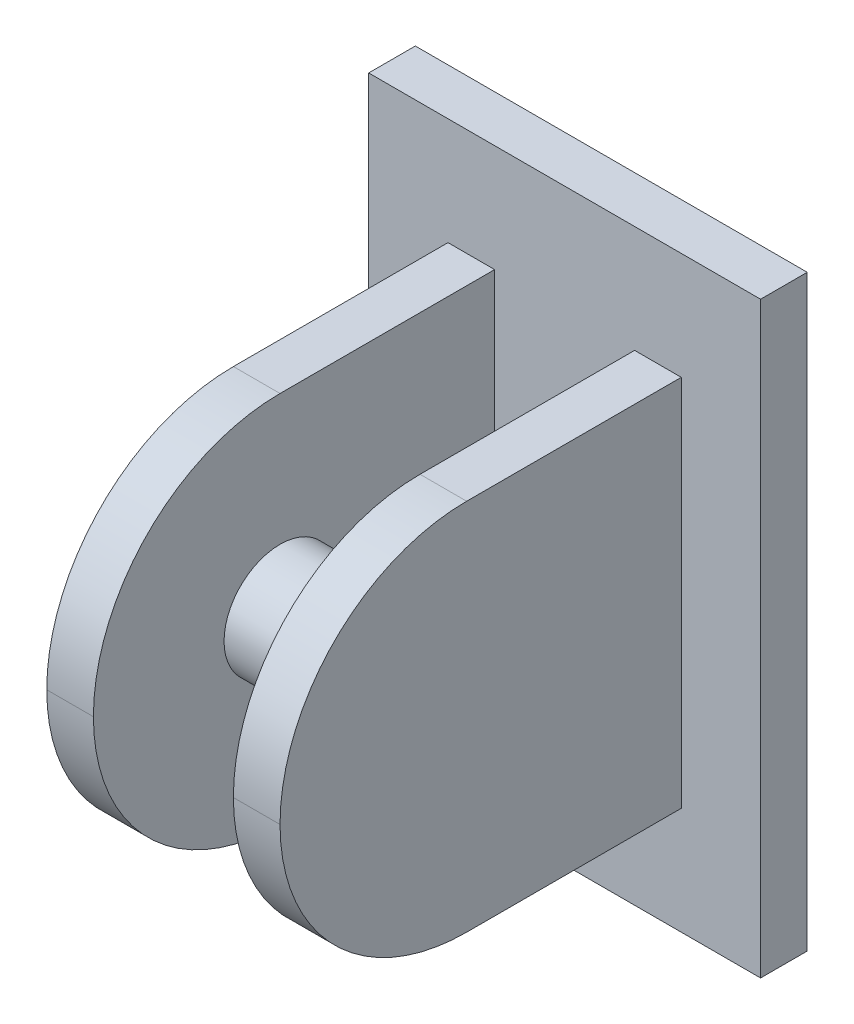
ISO-10303-21;
HEADER;
FILE_DESCRIPTION(('STEP AP214'),'2;1');
FILE_NAME('part.step','',(''),(''),'','','');
FILE_SCHEMA(('AUTOMOTIVE_DESIGN { 1 0 10303 214 1 1 1 1 }'));
ENDSEC;
DATA;
#1=APPLICATION_CONTEXT('core data for automotive mechanical design processes');
#2=APPLICATION_PROTOCOL_DEFINITION('international standard','automotive_design',2000,#1);
#3=PRODUCT_CONTEXT('',#1,'mechanical');
#4=PRODUCT('Part','Part','',(#3));
#5=PRODUCT_RELATED_PRODUCT_CATEGORY('part','',(#4));
#6=PRODUCT_DEFINITION_FORMATION('','',#4);
#7=PRODUCT_DEFINITION_CONTEXT('part definition',#1,'design');
#8=PRODUCT_DEFINITION('design','',#6,#7);
#9=PRODUCT_DEFINITION_SHAPE('','',#8);
#10=(LENGTH_UNIT() NAMED_UNIT(*) SI_UNIT(.MILLI.,.METRE.));
#11=(NAMED_UNIT(*) PLANE_ANGLE_UNIT() SI_UNIT($,.RADIAN.));
#12=(NAMED_UNIT(*) SI_UNIT($,.STERADIAN.) SOLID_ANGLE_UNIT());
#13=UNCERTAINTY_MEASURE_WITH_UNIT(LENGTH_MEASURE(1.E-05),#10,'distance_accuracy_value','');
#14=(GEOMETRIC_REPRESENTATION_CONTEXT(3) GLOBAL_UNCERTAINTY_ASSIGNED_CONTEXT((#13)) GLOBAL_UNIT_ASSIGNED_CONTEXT((#10,
#11,#12)) REPRESENTATION_CONTEXT('',''));
#15=CARTESIAN_POINT('',(0.,0.,0.));
#16=DIRECTION('',(0.,0.,1.));
#17=DIRECTION('',(1.,0.,0.));
#18=AXIS2_PLACEMENT_3D('',#15,#16,#17);
#19=CARTESIAN_POINT('',(-21.,-31.5,5.));
#20=DIRECTION('',(0.,0.,1.));
#21=DIRECTION('',(1.,0.,0.));
#22=AXIS2_PLACEMENT_3D('',#19,#20,#21);
#23=PLANE('',#22);
#24=DIRECTION('',(-1.,0.,0.));
#25=VECTOR('',#24,1.);
#26=CARTESIAN_POINT('',(-7.5,20.,5.));
#27=LINE('',#26,#25);
#28=CARTESIAN_POINT('',(-7.5,20.,5.));
#29=VERTEX_POINT('',#28);
#30=CARTESIAN_POINT('',(-12.5,20.,5.));
#31=VERTEX_POINT('',#30);
#32=EDGE_CURVE('E150',#29,#31,#27,.T.);
#33=ORIENTED_EDGE('',*,*,#32,.F.);
#34=DIRECTION('',(0.,1.,0.));
#35=VECTOR('',#34,1.);
#36=CARTESIAN_POINT('',(-7.5,20.,5.));
#37=LINE('',#36,#35);
#38=CARTESIAN_POINT('',(-7.5,-20.,5.));
#39=VERTEX_POINT('',#38);
#40=EDGE_CURVE('E124',#39,#29,#37,.T.);
#41=ORIENTED_EDGE('',*,*,#40,.F.);
#42=DIRECTION('',(1.,0.,0.));
#43=VECTOR('',#42,1.);
#44=CARTESIAN_POINT('',(-7.5,-20.,5.));
#45=LINE('',#44,#43);
#46=CARTESIAN_POINT('',(-12.5,-20.,5.));
#47=VERTEX_POINT('',#46);
#48=EDGE_CURVE('E156',#47,#39,#45,.T.);
#49=ORIENTED_EDGE('',*,*,#48,.F.);
#50=DIRECTION('',(0.,-1.,0.));
#51=VECTOR('',#50,1.);
#52=CARTESIAN_POINT('',(-12.5,20.,5.));
#53=LINE('',#52,#51);
#54=EDGE_CURVE('E153',#31,#47,#53,.T.);
#55=ORIENTED_EDGE('',*,*,#54,.F.);
#56=EDGE_LOOP('',(#33,#41,#49,#55));
#57=FACE_BOUND('',#56,.T.);
#58=DIRECTION('',(0.,-1.,0.));
#59=VECTOR('',#58,1.);
#60=CARTESIAN_POINT('',(-21.,31.5,5.));
#61=LINE('',#60,#59);
#62=CARTESIAN_POINT('',(-21.,31.5,5.));
#63=VERTEX_POINT('',#62);
#64=CARTESIAN_POINT('',(-21.,-31.5,5.));
#65=VERTEX_POINT('',#64);
#66=EDGE_CURVE('E176',#63,#65,#61,.T.);
#67=ORIENTED_EDGE('',*,*,#66,.T.);
#68=DIRECTION('',(1.,0.,0.));
#69=VECTOR('',#68,1.);
#70=CARTESIAN_POINT('',(-21.,-31.5,5.));
#71=LINE('',#70,#69);
#72=CARTESIAN_POINT('',(21.,-31.5,5.));
#73=VERTEX_POINT('',#72);
#74=EDGE_CURVE('E179',#65,#73,#71,.T.);
#75=ORIENTED_EDGE('',*,*,#74,.T.);
#76=DIRECTION('',(0.,1.,0.));
#77=VECTOR('',#76,1.);
#78=CARTESIAN_POINT('',(21.,31.5,5.));
#79=LINE('',#78,#77);
#80=CARTESIAN_POINT('',(21.,31.5,5.));
#81=VERTEX_POINT('',#80);
#82=EDGE_CURVE('E181',#73,#81,#79,.T.);
#83=ORIENTED_EDGE('',*,*,#82,.T.);
#84=DIRECTION('',(-1.,0.,0.));
#85=VECTOR('',#84,1.);
#86=CARTESIAN_POINT('',(-21.,31.5,5.));
#87=LINE('',#86,#85);
#88=EDGE_CURVE('E183',#81,#63,#87,.T.);
#89=ORIENTED_EDGE('',*,*,#88,.T.);
#90=EDGE_LOOP('',(#67,#75,#83,#89));
#91=FACE_BOUND('',#90,.T.);
#92=DIRECTION('',(1.,0.,0.));
#93=VECTOR('',#92,1.);
#94=CARTESIAN_POINT('',(7.5,-20.,5.));
#95=LINE('',#94,#93);
#96=CARTESIAN_POINT('',(7.5,-20.,5.));
#97=VERTEX_POINT('',#96);
#98=CARTESIAN_POINT('',(12.5,-20.,5.));
#99=VERTEX_POINT('',#98);
#100=EDGE_CURVE('E120',#97,#99,#95,.T.);
#101=ORIENTED_EDGE('',*,*,#100,.F.);
#102=DIRECTION('',(0.,-1.,0.));
#103=VECTOR('',#102,1.);
#104=CARTESIAN_POINT('',(7.5,20.,5.));
#105=LINE('',#104,#103);
#106=CARTESIAN_POINT('',(7.5,20.,5.));
#107=VERTEX_POINT('',#106);
#108=EDGE_CURVE('E128',#107,#97,#105,.T.);
#109=ORIENTED_EDGE('',*,*,#108,.F.);
#110=DIRECTION('',(-1.,0.,0.));
#111=VECTOR('',#110,1.);
#112=CARTESIAN_POINT('',(7.5,20.,5.));
#113=LINE('',#112,#111);
#114=CARTESIAN_POINT('',(12.5,20.,5.));
#115=VERTEX_POINT('',#114);
#116=EDGE_CURVE('E139',#115,#107,#113,.T.);
#117=ORIENTED_EDGE('',*,*,#116,.F.);
#118=DIRECTION('',(0.,1.,0.));
#119=VECTOR('',#118,1.);
#120=CARTESIAN_POINT('',(12.5,20.,5.));
#121=LINE('',#120,#119);
#122=EDGE_CURVE('E137',#99,#115,#121,.T.);
#123=ORIENTED_EDGE('',*,*,#122,.F.);
#124=EDGE_LOOP('',(#101,#109,#117,#123));
#125=FACE_BOUND('',#124,.T.);
#126=ADVANCED_FACE('F17',(#57,#91,#125),#23,.T.);
#127=CARTESIAN_POINT('',(-21.,31.5,5.));
#128=DIRECTION('',(1.,0.,0.));
#129=DIRECTION('',(0.,1.,0.));
#130=AXIS2_PLACEMENT_3D('',#127,#128,#129);
#131=PLANE('',#130);
#132=DIRECTION('',(0.,-1.,0.));
#133=VECTOR('',#132,1.);
#134=CARTESIAN_POINT('',(-21.,31.5,0.));
#135=LINE('',#134,#133);
#136=CARTESIAN_POINT('',(-21.,31.5,0.));
#137=VERTEX_POINT('',#136);
#138=CARTESIAN_POINT('',(-21.,-31.5,0.));
#139=VERTEX_POINT('',#138);
#140=EDGE_CURVE('E167',#137,#139,#135,.T.);
#141=ORIENTED_EDGE('',*,*,#140,.T.);
#142=DIRECTION('',(0.,0.,-1.));
#143=VECTOR('',#142,1.);
#144=CARTESIAN_POINT('',(-21.,-31.5,5.));
#145=LINE('',#144,#143);
#146=EDGE_CURVE('E194',#65,#139,#145,.T.);
#147=ORIENTED_EDGE('',*,*,#146,.F.);
#148=ORIENTED_EDGE('',*,*,#66,.F.);
#149=DIRECTION('',(0.,0.,-1.));
#150=VECTOR('',#149,1.);
#151=CARTESIAN_POINT('',(-21.,31.5,5.));
#152=LINE('',#151,#150);
#153=EDGE_CURVE('E185',#63,#137,#152,.T.);
#154=ORIENTED_EDGE('',*,*,#153,.T.);
#155=EDGE_LOOP('',(#141,#147,#148,#154));
#156=FACE_BOUND('',#155,.T.);
#157=ADVANCED_FACE('F19',(#156),#131,.F.);
#158=CARTESIAN_POINT('',(-21.,-31.5,5.));
#159=DIRECTION('',(0.,1.,0.));
#160=DIRECTION('',(0.,0.,1.));
#161=AXIS2_PLACEMENT_3D('',#158,#159,#160);
#162=PLANE('',#161);
#163=DIRECTION('',(1.,0.,0.));
#164=VECTOR('',#163,1.);
#165=CARTESIAN_POINT('',(-21.,-31.5,0.));
#166=LINE('',#165,#164);
#167=CARTESIAN_POINT('',(21.,-31.5,0.));
#168=VERTEX_POINT('',#167);
#169=EDGE_CURVE('E170',#139,#168,#166,.T.);
#170=ORIENTED_EDGE('',*,*,#169,.T.);
#171=DIRECTION('',(0.,0.,-1.));
#172=VECTOR('',#171,1.);
#173=CARTESIAN_POINT('',(21.,-31.5,5.));
#174=LINE('',#173,#172);
#175=EDGE_CURVE('E191',#73,#168,#174,.T.);
#176=ORIENTED_EDGE('',*,*,#175,.F.);
#177=ORIENTED_EDGE('',*,*,#74,.F.);
#178=ORIENTED_EDGE('',*,*,#146,.T.);
#179=EDGE_LOOP('',(#170,#176,#177,#178));
#180=FACE_BOUND('',#179,.T.);
#181=ADVANCED_FACE('F249',(#180),#162,.F.);
#182=CARTESIAN_POINT('',(21.,31.5,5.));
#183=DIRECTION('',(-1.,0.,0.));
#184=DIRECTION('',(0.,-1.,0.));
#185=AXIS2_PLACEMENT_3D('',#182,#183,#184);
#186=PLANE('',#185);
#187=DIRECTION('',(0.,1.,0.));
#188=VECTOR('',#187,1.);
#189=CARTESIAN_POINT('',(21.,31.5,0.));
#190=LINE('',#189,#188);
#191=CARTESIAN_POINT('',(21.,31.5,0.));
#192=VERTEX_POINT('',#191);
#193=EDGE_CURVE('E172',#168,#192,#190,.T.);
#194=ORIENTED_EDGE('',*,*,#193,.T.);
#195=DIRECTION('',(0.,0.,-1.));
#196=VECTOR('',#195,1.);
#197=CARTESIAN_POINT('',(21.,31.5,5.));
#198=LINE('',#197,#196);
#199=EDGE_CURVE('E188',#81,#192,#198,.T.);
#200=ORIENTED_EDGE('',*,*,#199,.F.);
#201=ORIENTED_EDGE('',*,*,#82,.F.);
#202=ORIENTED_EDGE('',*,*,#175,.T.);
#203=EDGE_LOOP('',(#194,#200,#201,#202));
#204=FACE_BOUND('',#203,.T.);
#205=ADVANCED_FACE('F260',(#204),#186,.F.);
#206=CARTESIAN_POINT('',(-21.,31.5,5.));
#207=DIRECTION('',(0.,-1.,0.));
#208=DIRECTION('',(0.,0.,-1.));
#209=AXIS2_PLACEMENT_3D('',#206,#207,#208);
#210=PLANE('',#209);
#211=DIRECTION('',(-1.,0.,0.));
#212=VECTOR('',#211,1.);
#213=CARTESIAN_POINT('',(-21.,31.5,0.));
#214=LINE('',#213,#212);
#215=EDGE_CURVE('E174',#192,#137,#214,.T.);
#216=ORIENTED_EDGE('',*,*,#215,.T.);
#217=ORIENTED_EDGE('',*,*,#153,.F.);
#218=ORIENTED_EDGE('',*,*,#88,.F.);
#219=ORIENTED_EDGE('',*,*,#199,.T.);
#220=EDGE_LOOP('',(#216,#217,#218,#219));
#221=FACE_BOUND('',#220,.T.);
#222=ADVANCED_FACE('F257',(#221),#210,.F.);
#223=CARTESIAN_POINT('',(-21.,-31.5,0.));
#224=DIRECTION('',(0.,0.,1.));
#225=DIRECTION('',(1.,0.,0.));
#226=AXIS2_PLACEMENT_3D('',#223,#224,#225);
#227=PLANE('',#226);
#228=ORIENTED_EDGE('',*,*,#140,.F.);
#229=ORIENTED_EDGE('',*,*,#215,.F.);
#230=ORIENTED_EDGE('',*,*,#193,.F.);
#231=ORIENTED_EDGE('',*,*,#169,.F.);
#232=EDGE_LOOP('',(#228,#229,#230,#231));
#233=FACE_BOUND('',#232,.T.);
#234=ADVANCED_FACE('F255',(#233),#227,.F.);
#235=CARTESIAN_POINT('',(-7.5,20.,48.));
#236=DIRECTION('',(-1.,0.,0.));
#237=DIRECTION('',(0.,-1.,0.));
#238=AXIS2_PLACEMENT_3D('',#235,#236,#237);
#239=PLANE('',#238);
#240=CARTESIAN_POINT('',(-7.5,0.,28.));
#241=DIRECTION('',(-1.,0.,0.));
#242=DIRECTION('',(0.,-1.,0.));
#243=AXIS2_PLACEMENT_3D('',#240,#241,#242);
#244=CIRCLE('',#243,6.);
#245=CARTESIAN_POINT('',(-7.5,-6.,28.));
#246=VERTEX_POINT('',#245);
#247=EDGE_CURVE('E228',#246,#246,#244,.T.);
#248=ORIENTED_EDGE('',*,*,#247,.T.);
#249=EDGE_LOOP('',(#248));
#250=FACE_BOUND('',#249,.T.);
#251=CARTESIAN_POINT('',(-7.5,0.,28.));
#252=DIRECTION('',(-1.,0.,0.));
#253=DIRECTION('',(0.,-1.,0.));
#254=AXIS2_PLACEMENT_3D('',#251,#252,#253);
#255=CIRCLE('',#254,20.);
#256=CARTESIAN_POINT('',(-7.5,20.,28.));
#257=VERTEX_POINT('',#256);
#258=CARTESIAN_POINT('',(-7.5,0.,48.));
#259=VERTEX_POINT('',#258);
#260=EDGE_CURVE('E197',#257,#259,#255,.F.);
#261=ORIENTED_EDGE('',*,*,#260,.T.);
#262=CARTESIAN_POINT('',(-7.5,0.,28.));
#263=DIRECTION('',(-1.,0.,0.));
#264=DIRECTION('',(0.,-1.,0.));
#265=AXIS2_PLACEMENT_3D('',#262,#263,#264);
#266=CIRCLE('',#265,20.);
#267=CARTESIAN_POINT('',(-7.5,-20.,28.));
#268=VERTEX_POINT('',#267);
#269=EDGE_CURVE('E199',#259,#268,#266,.F.);
#270=ORIENTED_EDGE('',*,*,#269,.T.);
#271=DIRECTION('',(0.,0.,-1.));
#272=VECTOR('',#271,1.);
#273=CARTESIAN_POINT('',(-7.5,-20.,48.));
#274=LINE('',#273,#272);
#275=EDGE_CURVE('E159',#268,#39,#274,.T.);
#276=ORIENTED_EDGE('',*,*,#275,.T.);
#277=ORIENTED_EDGE('',*,*,#40,.T.);
#278=DIRECTION('',(0.,0.,-1.));
#279=VECTOR('',#278,1.);
#280=CARTESIAN_POINT('',(-7.5,20.,48.));
#281=LINE('',#280,#279);
#282=EDGE_CURVE('E165',#257,#29,#281,.T.);
#283=ORIENTED_EDGE('',*,*,#282,.F.);
#284=EDGE_LOOP('',(#261,#270,#276,#277,#283));
#285=FACE_BOUND('',#284,.T.);
#286=ADVANCED_FACE('F280',(#250,#285),#239,.F.);
#287=CARTESIAN_POINT('',(-7.5,20.,48.));
#288=DIRECTION('',(0.,-1.,0.));
#289=DIRECTION('',(0.,0.,-1.));
#290=AXIS2_PLACEMENT_3D('',#287,#288,#289);
#291=PLANE('',#290);
#292=DIRECTION('',(0.,0.,-1.));
#293=VECTOR('',#292,1.);
#294=CARTESIAN_POINT('',(-12.5,20.,48.));
#295=LINE('',#294,#293);
#296=CARTESIAN_POINT('',(-12.5,20.,28.));
#297=VERTEX_POINT('',#296);
#298=EDGE_CURVE('E163',#297,#31,#295,.T.);
#299=ORIENTED_EDGE('',*,*,#298,.F.);
#300=DIRECTION('',(-1.,0.,0.));
#301=VECTOR('',#300,1.);
#302=CARTESIAN_POINT('',(-7.5,20.,28.));
#303=LINE('',#302,#301);
#304=EDGE_CURVE('E11',#297,#257,#303,.F.);
#305=ORIENTED_EDGE('',*,*,#304,.T.);
#306=ORIENTED_EDGE('',*,*,#282,.T.);
#307=ORIENTED_EDGE('',*,*,#32,.T.);
#308=EDGE_LOOP('',(#299,#305,#306,#307));
#309=FACE_BOUND('',#308,.T.);
#310=ADVANCED_FACE('F284',(#309),#291,.F.);
#311=CARTESIAN_POINT('',(-12.5,20.,48.));
#312=DIRECTION('',(1.,0.,0.));
#313=DIRECTION('',(0.,1.,0.));
#314=AXIS2_PLACEMENT_3D('',#311,#312,#313);
#315=PLANE('',#314);
#316=DIRECTION('',(0.,0.,-1.));
#317=VECTOR('',#316,1.);
#318=CARTESIAN_POINT('',(-12.5,-20.,48.));
#319=LINE('',#318,#317);
#320=CARTESIAN_POINT('',(-12.5,-20.,28.));
#321=VERTEX_POINT('',#320);
#322=EDGE_CURVE('E161',#321,#47,#319,.T.);
#323=ORIENTED_EDGE('',*,*,#322,.F.);
#324=CARTESIAN_POINT('',(-12.5,0.,28.));
#325=DIRECTION('',(1.,0.,0.));
#326=DIRECTION('',(0.,1.,0.));
#327=AXIS2_PLACEMENT_3D('',#324,#325,#326);
#328=CIRCLE('',#327,20.);
#329=CARTESIAN_POINT('',(-12.5,0.,48.));
#330=VERTEX_POINT('',#329);
#331=EDGE_CURVE('E206',#321,#330,#328,.F.);
#332=ORIENTED_EDGE('',*,*,#331,.T.);
#333=CARTESIAN_POINT('',(-12.5,0.,28.));
#334=DIRECTION('',(1.,0.,0.));
#335=DIRECTION('',(0.,1.,0.));
#336=AXIS2_PLACEMENT_3D('',#333,#334,#335);
#337=CIRCLE('',#336,20.);
#338=EDGE_CURVE('E204',#330,#297,#337,.F.);
#339=ORIENTED_EDGE('',*,*,#338,.T.);
#340=ORIENTED_EDGE('',*,*,#298,.T.);
#341=ORIENTED_EDGE('',*,*,#54,.T.);
#342=EDGE_LOOP('',(#323,#332,#339,#340,#341));
#343=FACE_BOUND('',#342,.T.);
#344=ADVANCED_FACE('F289',(#343),#315,.F.);
#345=CARTESIAN_POINT('',(-7.5,-20.,48.));
#346=DIRECTION('',(0.,1.,0.));
#347=DIRECTION('',(-1.,0.,0.));
#348=AXIS2_PLACEMENT_3D('',#345,#346,#347);
#349=PLANE('',#348);
#350=ORIENTED_EDGE('',*,*,#275,.F.);
#351=DIRECTION('',(1.,0.,0.));
#352=VECTOR('',#351,1.);
#353=CARTESIAN_POINT('',(-7.5,-20.,28.));
#354=LINE('',#353,#352);
#355=EDGE_CURVE('E201',#268,#321,#354,.F.);
#356=ORIENTED_EDGE('',*,*,#355,.T.);
#357=ORIENTED_EDGE('',*,*,#322,.T.);
#358=ORIENTED_EDGE('',*,*,#48,.T.);
#359=EDGE_LOOP('',(#350,#356,#357,#358));
#360=FACE_BOUND('',#359,.T.);
#361=ADVANCED_FACE('F297',(#360),#349,.F.);
#362=CARTESIAN_POINT('',(7.5,20.,48.));
#363=DIRECTION('',(1.,0.,0.));
#364=DIRECTION('',(0.,1.,0.));
#365=AXIS2_PLACEMENT_3D('',#362,#363,#364);
#366=PLANE('',#365);
#367=CARTESIAN_POINT('',(7.5,0.,28.));
#368=DIRECTION('',(1.,0.,0.));
#369=DIRECTION('',(0.,1.,0.));
#370=AXIS2_PLACEMENT_3D('',#367,#368,#369);
#371=CIRCLE('',#370,6.);
#372=CARTESIAN_POINT('',(7.5,6.,28.));
#373=VERTEX_POINT('',#372);
#374=EDGE_CURVE('E335',#373,#373,#371,.T.);
#375=ORIENTED_EDGE('',*,*,#374,.T.);
#376=EDGE_LOOP('',(#375));
#377=FACE_BOUND('',#376,.T.);
#378=DIRECTION('',(0.,0.,-1.));
#379=VECTOR('',#378,1.);
#380=CARTESIAN_POINT('',(7.5,-20.,48.));
#381=LINE('',#380,#379);
#382=CARTESIAN_POINT('',(7.5,-20.,28.));
#383=VERTEX_POINT('',#382);
#384=EDGE_CURVE('E115',#383,#97,#381,.T.);
#385=ORIENTED_EDGE('',*,*,#384,.F.);
#386=CARTESIAN_POINT('',(7.5,0.,28.));
#387=DIRECTION('',(1.,0.,0.));
#388=DIRECTION('',(0.,1.,0.));
#389=AXIS2_PLACEMENT_3D('',#386,#387,#388);
#390=CIRCLE('',#389,20.);
#391=CARTESIAN_POINT('',(7.5,0.,48.));
#392=VERTEX_POINT('',#391);
#393=EDGE_CURVE('E37',#383,#392,#390,.F.);
#394=ORIENTED_EDGE('',*,*,#393,.T.);
#395=CARTESIAN_POINT('',(7.5,0.,28.));
#396=DIRECTION('',(1.,0.,0.));
#397=DIRECTION('',(0.,1.,0.));
#398=AXIS2_PLACEMENT_3D('',#395,#396,#397);
#399=CIRCLE('',#398,20.);
#400=CARTESIAN_POINT('',(7.5,20.,28.));
#401=VERTEX_POINT('',#400);
#402=EDGE_CURVE('E32',#392,#401,#399,.F.);
#403=ORIENTED_EDGE('',*,*,#402,.T.);
#404=DIRECTION('',(0.,0.,-1.));
#405=VECTOR('',#404,1.);
#406=CARTESIAN_POINT('',(7.5,20.,48.));
#407=LINE('',#406,#405);
#408=EDGE_CURVE('E130',#401,#107,#407,.T.);
#409=ORIENTED_EDGE('',*,*,#408,.T.);
#410=ORIENTED_EDGE('',*,*,#108,.T.);
#411=EDGE_LOOP('',(#385,#394,#403,#409,#410));
#412=FACE_BOUND('',#411,.T.);
#413=ADVANCED_FACE('F129',(#377,#412),#366,.F.);
#414=CARTESIAN_POINT('',(7.5,-20.,48.));
#415=DIRECTION('',(0.,1.,0.));
#416=DIRECTION('',(0.,0.,1.));
#417=AXIS2_PLACEMENT_3D('',#414,#415,#416);
#418=PLANE('',#417);
#419=DIRECTION('',(0.,0.,-1.));
#420=VECTOR('',#419,1.);
#421=CARTESIAN_POINT('',(12.5,-20.,48.));
#422=LINE('',#421,#420);
#423=CARTESIAN_POINT('',(12.5,-20.,28.));
#424=VERTEX_POINT('',#423);
#425=EDGE_CURVE('E125',#424,#99,#422,.T.);
#426=ORIENTED_EDGE('',*,*,#425,.F.);
#427=DIRECTION('',(1.,0.,0.));
#428=VECTOR('',#427,1.);
#429=CARTESIAN_POINT('',(7.5,-20.,28.));
#430=LINE('',#429,#428);
#431=EDGE_CURVE('E123',#424,#383,#430,.F.);
#432=ORIENTED_EDGE('',*,*,#431,.T.);
#433=ORIENTED_EDGE('',*,*,#384,.T.);
#434=ORIENTED_EDGE('',*,*,#100,.T.);
#435=EDGE_LOOP('',(#426,#432,#433,#434));
#436=FACE_BOUND('',#435,.T.);
#437=ADVANCED_FACE('F118',(#436),#418,.F.);
#438=CARTESIAN_POINT('',(12.5,20.,48.));
#439=DIRECTION('',(-1.,0.,0.));
#440=DIRECTION('',(0.,-1.,0.));
#441=AXIS2_PLACEMENT_3D('',#438,#439,#440);
#442=PLANE('',#441);
#443=CARTESIAN_POINT('',(12.5,0.,28.));
#444=DIRECTION('',(-1.,0.,0.));
#445=DIRECTION('',(0.,-1.,0.));
#446=AXIS2_PLACEMENT_3D('',#443,#444,#445);
#447=CIRCLE('',#446,20.);
#448=CARTESIAN_POINT('',(12.5,20.,28.));
#449=VERTEX_POINT('',#448);
#450=CARTESIAN_POINT('',(12.5,0.,48.));
#451=VERTEX_POINT('',#450);
#452=EDGE_CURVE('E208',#449,#451,#447,.F.);
#453=ORIENTED_EDGE('',*,*,#452,.T.);
#454=CARTESIAN_POINT('',(12.5,0.,28.));
#455=DIRECTION('',(-1.,0.,0.));
#456=DIRECTION('',(0.,-1.,0.));
#457=AXIS2_PLACEMENT_3D('',#454,#455,#456);
#458=CIRCLE('',#457,20.);
#459=EDGE_CURVE('E210',#451,#424,#458,.F.);
#460=ORIENTED_EDGE('',*,*,#459,.T.);
#461=ORIENTED_EDGE('',*,*,#425,.T.);
#462=ORIENTED_EDGE('',*,*,#122,.T.);
#463=DIRECTION('',(0.,0.,-1.));
#464=VECTOR('',#463,1.);
#465=CARTESIAN_POINT('',(12.5,20.,48.));
#466=LINE('',#465,#464);
#467=EDGE_CURVE('E145',#449,#115,#466,.T.);
#468=ORIENTED_EDGE('',*,*,#467,.F.);
#469=EDGE_LOOP('',(#453,#460,#461,#462,#468));
#470=FACE_BOUND('',#469,.T.);
#471=ADVANCED_FACE('F221',(#470),#442,.F.);
#472=CARTESIAN_POINT('',(7.5,20.,48.));
#473=DIRECTION('',(0.,-1.,0.));
#474=DIRECTION('',(0.,0.,-1.));
#475=AXIS2_PLACEMENT_3D('',#472,#473,#474);
#476=PLANE('',#475);
#477=ORIENTED_EDGE('',*,*,#408,.F.);
#478=DIRECTION('',(-1.,0.,0.));
#479=VECTOR('',#478,1.);
#480=CARTESIAN_POINT('',(12.5,20.,28.));
#481=LINE('',#480,#479);
#482=EDGE_CURVE('E25',#401,#449,#481,.F.);
#483=ORIENTED_EDGE('',*,*,#482,.T.);
#484=ORIENTED_EDGE('',*,*,#467,.T.);
#485=ORIENTED_EDGE('',*,*,#116,.T.);
#486=EDGE_LOOP('',(#477,#483,#484,#485));
#487=FACE_BOUND('',#486,.T.);
#488=ADVANCED_FACE('F217',(#487),#476,.F.);
#489=CARTESIAN_POINT('',(-7.5,0.,28.));
#490=DIRECTION('',(-1.,0.,0.));
#491=DIRECTION('',(0.,0.,1.));
#492=AXIS2_PLACEMENT_3D('',#489,#490,#491);
#493=CYLINDRICAL_SURFACE('',#492,20.);
#494=ORIENTED_EDGE('',*,*,#304,.F.);
#495=ORIENTED_EDGE('',*,*,#338,.F.);
#496=DIRECTION('',(-1.,0.,0.));
#497=VECTOR('',#496,1.);
#498=CARTESIAN_POINT('',(-7.5,0.,48.));
#499=LINE('',#498,#497);
#500=EDGE_CURVE('E134',#259,#330,#499,.T.);
#501=ORIENTED_EDGE('',*,*,#500,.F.);
#502=ORIENTED_EDGE('',*,*,#260,.F.);
#503=EDGE_LOOP('',(#494,#495,#501,#502));
#504=FACE_BOUND('',#503,.T.);
#505=ADVANCED_FACE('F311',(#504),#493,.T.);
#506=CARTESIAN_POINT('',(-7.5,0.,28.));
#507=DIRECTION('',(1.,0.,0.));
#508=DIRECTION('',(0.,1.,0.));
#509=AXIS2_PLACEMENT_3D('',#506,#507,#508);
#510=CYLINDRICAL_SURFACE('',#509,20.);
#511=ORIENTED_EDGE('',*,*,#331,.F.);
#512=ORIENTED_EDGE('',*,*,#355,.F.);
#513=ORIENTED_EDGE('',*,*,#269,.F.);
#514=ORIENTED_EDGE('',*,*,#500,.T.);
#515=EDGE_LOOP('',(#511,#512,#513,#514));
#516=FACE_BOUND('',#515,.T.);
#517=ADVANCED_FACE('F241',(#516),#510,.T.);
#518=CARTESIAN_POINT('',(7.5,0.,28.));
#519=DIRECTION('',(1.,0.,0.));
#520=DIRECTION('',(0.,0.,-1.));
#521=AXIS2_PLACEMENT_3D('',#518,#519,#520);
#522=CYLINDRICAL_SURFACE('',#521,20.);
#523=ORIENTED_EDGE('',*,*,#482,.F.);
#524=ORIENTED_EDGE('',*,*,#402,.F.);
#525=DIRECTION('',(-1.,0.,0.));
#526=VECTOR('',#525,1.);
#527=CARTESIAN_POINT('',(7.5,0.,48.));
#528=LINE('',#527,#526);
#529=EDGE_CURVE('E225',#451,#392,#528,.T.);
#530=ORIENTED_EDGE('',*,*,#529,.F.);
#531=ORIENTED_EDGE('',*,*,#452,.F.);
#532=EDGE_LOOP('',(#523,#524,#530,#531));
#533=FACE_BOUND('',#532,.T.);
#534=ADVANCED_FACE('F223',(#533),#522,.T.);
#535=CARTESIAN_POINT('',(7.5,0.,28.));
#536=DIRECTION('',(-1.,0.,0.));
#537=DIRECTION('',(0.,0.,1.));
#538=AXIS2_PLACEMENT_3D('',#535,#536,#537);
#539=CYLINDRICAL_SURFACE('',#538,20.);
#540=ORIENTED_EDGE('',*,*,#393,.F.);
#541=ORIENTED_EDGE('',*,*,#431,.F.);
#542=ORIENTED_EDGE('',*,*,#459,.F.);
#543=ORIENTED_EDGE('',*,*,#529,.T.);
#544=EDGE_LOOP('',(#540,#541,#542,#543));
#545=FACE_BOUND('',#544,.T.);
#546=ADVANCED_FACE('F230',(#545),#539,.T.);
#547=CARTESIAN_POINT('',(-29.4705627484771,0.,28.));
#548=DIRECTION('',(1.,0.,0.));
#549=DIRECTION('',(0.,1.,0.));
#550=AXIS2_PLACEMENT_3D('',#547,#548,#549);
#551=CYLINDRICAL_SURFACE('',#550,6.);
#552=ORIENTED_EDGE('',*,*,#374,.F.);
#553=EDGE_LOOP('',(#552));
#554=FACE_BOUND('',#553,.T.);
#555=ORIENTED_EDGE('',*,*,#247,.F.);
#556=EDGE_LOOP('',(#555));
#557=FACE_BOUND('',#556,.T.);
#558=ADVANCED_FACE('F232',(#554,#557),#551,.T.);
#559=CLOSED_SHELL('',(#126,#157,#181,#205,#222,#234,#286,#310,#344,#361,#413,#437,#471,#488,
#505,#517,#534,#546,#558));
#560=MANIFOLD_SOLID_BREP('B1',#559);
#561=ADVANCED_BREP_SHAPE_REPRESENTATION('',(#18,#560),#14);
#562=SHAPE_DEFINITION_REPRESENTATION(#9,#561);
ENDSEC;
END-ISO-10303-21;
